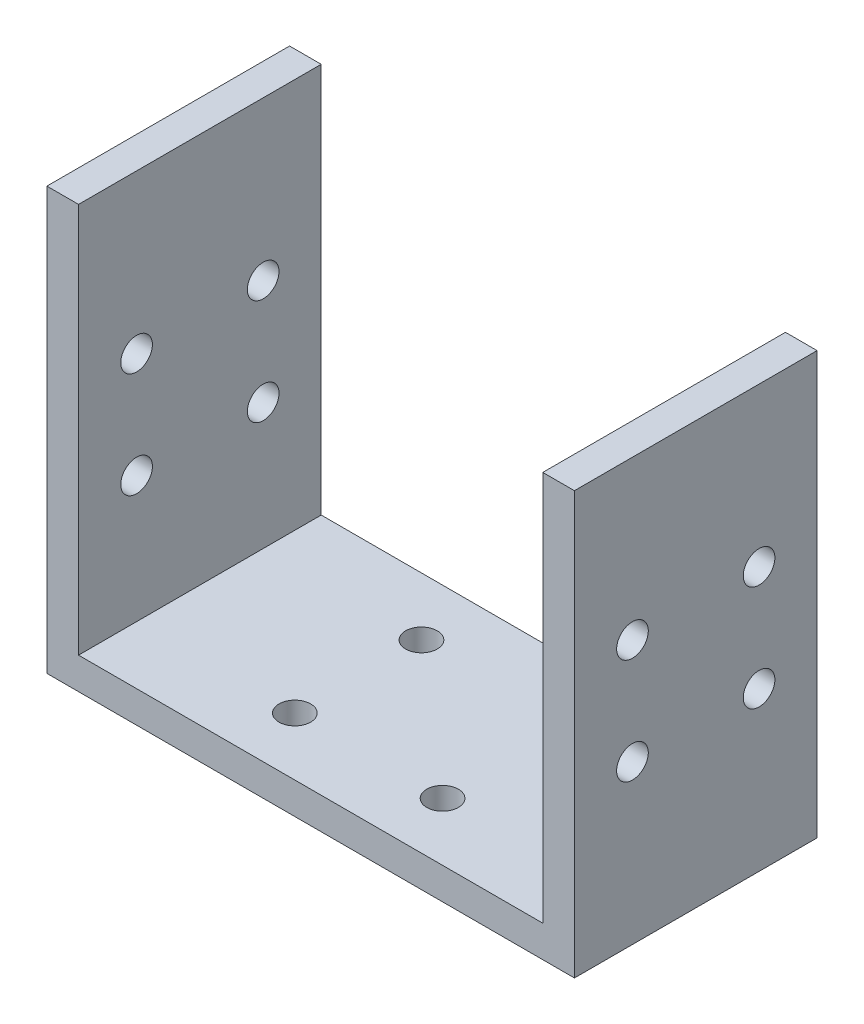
ISO-10303-21;
HEADER;
FILE_DESCRIPTION(('STEP AP214'),'2;1');
FILE_NAME('part.step','',(''),(''),'','','');
FILE_SCHEMA(('AUTOMOTIVE_DESIGN { 1 0 10303 214 1 1 1 1 }'));
ENDSEC;
DATA;
#1=APPLICATION_CONTEXT('core data for automotive mechanical design processes');
#2=APPLICATION_PROTOCOL_DEFINITION('international standard','automotive_design',2000,#1);
#3=PRODUCT_CONTEXT('',#1,'mechanical');
#4=PRODUCT('Part','Part','',(#3));
#5=PRODUCT_RELATED_PRODUCT_CATEGORY('part','',(#4));
#6=PRODUCT_DEFINITION_FORMATION('','',#4);
#7=PRODUCT_DEFINITION_CONTEXT('part definition',#1,'design');
#8=PRODUCT_DEFINITION('design','',#6,#7);
#9=PRODUCT_DEFINITION_SHAPE('','',#8);
#10=(LENGTH_UNIT() NAMED_UNIT(*) SI_UNIT(.MILLI.,.METRE.));
#11=(NAMED_UNIT(*) PLANE_ANGLE_UNIT() SI_UNIT($,.RADIAN.));
#12=(NAMED_UNIT(*) SI_UNIT($,.STERADIAN.) SOLID_ANGLE_UNIT());
#13=UNCERTAINTY_MEASURE_WITH_UNIT(LENGTH_MEASURE(1.E-05),#10,'distance_accuracy_value','');
#14=(GEOMETRIC_REPRESENTATION_CONTEXT(3) GLOBAL_UNCERTAINTY_ASSIGNED_CONTEXT((#13)) GLOBAL_UNIT_ASSIGNED_CONTEXT((#10,
#11,#12)) REPRESENTATION_CONTEXT('',''));
#15=CARTESIAN_POINT('',(0.,0.,0.));
#16=DIRECTION('',(0.,0.,1.));
#17=DIRECTION('',(1.,0.,0.));
#18=AXIS2_PLACEMENT_3D('',#15,#16,#17);
#19=CARTESIAN_POINT('',(0.,40.,0.));
#20=DIRECTION('',(0.,-1.,0.));
#21=DIRECTION('',(0.,0.,-1.));
#22=AXIS2_PLACEMENT_3D('',#19,#20,#21);
#23=PLANE('',#22);
#24=DIRECTION('',(0.,0.,-1.));
#25=VECTOR('',#24,1.);
#26=CARTESIAN_POINT('',(22.,40.,0.));
#27=LINE('',#26,#25);
#28=CARTESIAN_POINT('',(22.,40.,11.5));
#29=VERTEX_POINT('',#28);
#30=CARTESIAN_POINT('',(22.,40.,-11.5));
#31=VERTEX_POINT('',#30);
#32=EDGE_CURVE('E124',#29,#31,#27,.T.);
#33=ORIENTED_EDGE('',*,*,#32,.F.);
#34=DIRECTION('',(1.,0.,0.));
#35=VECTOR('',#34,1.);
#36=CARTESIAN_POINT('',(-25.,40.,11.5));
#37=LINE('',#36,#35);
#38=CARTESIAN_POINT('',(25.,40.,11.5));
#39=VERTEX_POINT('',#38);
#40=EDGE_CURVE('E67',#29,#39,#37,.T.);
#41=ORIENTED_EDGE('',*,*,#40,.T.);
#42=DIRECTION('',(0.,0.,-1.));
#43=VECTOR('',#42,1.);
#44=CARTESIAN_POINT('',(25.,40.,11.5));
#45=LINE('',#44,#43);
#46=CARTESIAN_POINT('',(25.,40.,-11.5));
#47=VERTEX_POINT('',#46);
#48=EDGE_CURVE('E151',#39,#47,#45,.T.);
#49=ORIENTED_EDGE('',*,*,#48,.T.);
#50=DIRECTION('',(-1.,0.,0.));
#51=VECTOR('',#50,1.);
#52=CARTESIAN_POINT('',(-25.,40.,-11.5));
#53=LINE('',#52,#51);
#54=EDGE_CURVE('E96',#47,#31,#53,.T.);
#55=ORIENTED_EDGE('',*,*,#54,.T.);
#56=EDGE_LOOP('',(#33,#41,#49,#55));
#57=FACE_BOUND('',#56,.T.);
#58=ADVANCED_FACE('F41',(#57),#23,.F.);
#59=DIRECTION('',(0.,0.,1.));
#60=VECTOR('',#59,1.);
#61=CARTESIAN_POINT('',(-22.,40.,0.));
#62=LINE('',#61,#60);
#63=CARTESIAN_POINT('',(-22.,40.,-11.5));
#64=VERTEX_POINT('',#63);
#65=CARTESIAN_POINT('',(-22.,40.,11.5));
#66=VERTEX_POINT('',#65);
#67=EDGE_CURVE('E143',#64,#66,#62,.T.);
#68=ORIENTED_EDGE('',*,*,#67,.F.);
#69=CARTESIAN_POINT('',(-25.,40.,-11.5));
#70=VERTEX_POINT('',#69);
#71=EDGE_CURVE('E153',#64,#70,#53,.T.);
#72=ORIENTED_EDGE('',*,*,#71,.T.);
#73=DIRECTION('',(0.,0.,1.));
#74=VECTOR('',#73,1.);
#75=CARTESIAN_POINT('',(-25.,40.,11.5));
#76=LINE('',#75,#74);
#77=CARTESIAN_POINT('',(-25.,40.,11.5));
#78=VERTEX_POINT('',#77);
#79=EDGE_CURVE('E155',#70,#78,#76,.T.);
#80=ORIENTED_EDGE('',*,*,#79,.T.);
#81=EDGE_CURVE('E157',#78,#66,#37,.T.);
#82=ORIENTED_EDGE('',*,*,#81,.T.);
#83=EDGE_LOOP('',(#68,#72,#80,#82));
#84=FACE_BOUND('',#83,.T.);
#85=ADVANCED_FACE('F250',(#84),#23,.F.);
#86=CARTESIAN_POINT('',(25.,40.,11.5));
#87=DIRECTION('',(-1.,0.,0.));
#88=DIRECTION('',(0.,0.,1.));
#89=AXIS2_PLACEMENT_3D('',#86,#87,#88);
#90=PLANE('',#89);
#91=CARTESIAN_POINT('',(25.,25.,6.));
#92=DIRECTION('',(-1.,0.,0.));
#93=DIRECTION('',(0.,0.,1.));
#94=AXIS2_PLACEMENT_3D('',#91,#92,#93);
#95=CIRCLE('',#94,1.5);
#96=CARTESIAN_POINT('',(25.,25.,7.5));
#97=VERTEX_POINT('',#96);
#98=EDGE_CURVE('E204',#97,#97,#95,.T.);
#99=ORIENTED_EDGE('',*,*,#98,.T.);
#100=EDGE_LOOP('',(#99));
#101=FACE_BOUND('',#100,.T.);
#102=CARTESIAN_POINT('',(25.,25.,-6.));
#103=DIRECTION('',(-1.,0.,0.));
#104=DIRECTION('',(0.,0.,1.));
#105=AXIS2_PLACEMENT_3D('',#102,#103,#104);
#106=CIRCLE('',#105,1.5);
#107=CARTESIAN_POINT('',(25.,25.,-4.5));
#108=VERTEX_POINT('',#107);
#109=EDGE_CURVE('E189',#108,#108,#106,.T.);
#110=ORIENTED_EDGE('',*,*,#109,.T.);
#111=EDGE_LOOP('',(#110));
#112=FACE_BOUND('',#111,.T.);
#113=CARTESIAN_POINT('',(25.,15.,-6.));
#114=DIRECTION('',(-1.,0.,0.));
#115=DIRECTION('',(0.,0.,1.));
#116=AXIS2_PLACEMENT_3D('',#113,#114,#115);
#117=CIRCLE('',#116,1.5);
#118=CARTESIAN_POINT('',(25.,15.,-4.5));
#119=VERTEX_POINT('',#118);
#120=EDGE_CURVE('E185',#119,#119,#117,.T.);
#121=ORIENTED_EDGE('',*,*,#120,.T.);
#122=EDGE_LOOP('',(#121));
#123=FACE_BOUND('',#122,.T.);
#124=CARTESIAN_POINT('',(25.,15.,6.));
#125=DIRECTION('',(-1.,0.,0.));
#126=DIRECTION('',(0.,0.,1.));
#127=AXIS2_PLACEMENT_3D('',#124,#125,#126);
#128=CIRCLE('',#127,1.5);
#129=CARTESIAN_POINT('',(25.,15.,7.5));
#130=VERTEX_POINT('',#129);
#131=EDGE_CURVE('E181',#130,#130,#128,.T.);
#132=ORIENTED_EDGE('',*,*,#131,.T.);
#133=EDGE_LOOP('',(#132));
#134=FACE_BOUND('',#133,.T.);
#135=DIRECTION('',(0.,0.,-1.));
#136=VECTOR('',#135,1.);
#137=CARTESIAN_POINT('',(25.,0.,11.5));
#138=LINE('',#137,#136);
#139=CARTESIAN_POINT('',(25.,0.,11.5));
#140=VERTEX_POINT('',#139);
#141=CARTESIAN_POINT('',(25.,0.,-11.5));
#142=VERTEX_POINT('',#141);
#143=EDGE_CURVE('E126',#140,#142,#138,.T.);
#144=ORIENTED_EDGE('',*,*,#143,.T.);
#145=DIRECTION('',(0.,-1.,0.));
#146=VECTOR('',#145,1.);
#147=CARTESIAN_POINT('',(25.,40.,-11.5));
#148=LINE('',#147,#146);
#149=EDGE_CURVE('E11',#47,#142,#148,.T.);
#150=ORIENTED_EDGE('',*,*,#149,.F.);
#151=ORIENTED_EDGE('',*,*,#48,.F.);
#152=DIRECTION('',(0.,-1.,0.));
#153=VECTOR('',#152,1.);
#154=CARTESIAN_POINT('',(25.,40.,11.5));
#155=LINE('',#154,#153);
#156=EDGE_CURVE('E160',#39,#140,#155,.T.);
#157=ORIENTED_EDGE('',*,*,#156,.T.);
#158=EDGE_LOOP('',(#144,#150,#151,#157));
#159=FACE_BOUND('',#158,.T.);
#160=ADVANCED_FACE('F43',(#101,#112,#123,#134,#159),#90,.F.);
#161=CARTESIAN_POINT('',(-25.,40.,-11.5));
#162=DIRECTION('',(0.,0.,1.));
#163=DIRECTION('',(1.,0.,0.));
#164=AXIS2_PLACEMENT_3D('',#161,#162,#163);
#165=PLANE('',#164);
#166=ORIENTED_EDGE('',*,*,#71,.F.);
#167=DIRECTION('',(0.,-1.,0.));
#168=VECTOR('',#167,1.);
#169=CARTESIAN_POINT('',(-22.,40.,-11.5));
#170=LINE('',#169,#168);
#171=CARTESIAN_POINT('',(-22.,3.,-11.5));
#172=VERTEX_POINT('',#171);
#173=EDGE_CURVE('E58',#64,#172,#170,.T.);
#174=ORIENTED_EDGE('',*,*,#173,.T.);
#175=DIRECTION('',(-1.,0.,0.));
#176=VECTOR('',#175,1.);
#177=CARTESIAN_POINT('',(0.,3.,-11.5));
#178=LINE('',#177,#176);
#179=CARTESIAN_POINT('',(22.,3.,-11.5));
#180=VERTEX_POINT('',#179);
#181=EDGE_CURVE('E130',#180,#172,#178,.T.);
#182=ORIENTED_EDGE('',*,*,#181,.F.);
#183=DIRECTION('',(0.,-1.,0.));
#184=VECTOR('',#183,1.);
#185=CARTESIAN_POINT('',(22.,40.,-11.5));
#186=LINE('',#185,#184);
#187=EDGE_CURVE('E119',#31,#180,#186,.T.);
#188=ORIENTED_EDGE('',*,*,#187,.F.);
#189=ORIENTED_EDGE('',*,*,#54,.F.);
#190=ORIENTED_EDGE('',*,*,#149,.T.);
#191=DIRECTION('',(-1.,0.,0.));
#192=VECTOR('',#191,1.);
#193=CARTESIAN_POINT('',(-25.,0.,-11.5));
#194=LINE('',#193,#192);
#195=CARTESIAN_POINT('',(-25.,0.,-11.5));
#196=VERTEX_POINT('',#195);
#197=EDGE_CURVE('E163',#142,#196,#194,.T.);
#198=ORIENTED_EDGE('',*,*,#197,.T.);
#199=DIRECTION('',(0.,-1.,0.));
#200=VECTOR('',#199,1.);
#201=CARTESIAN_POINT('',(-25.,40.,-11.5));
#202=LINE('',#201,#200);
#203=EDGE_CURVE('E50',#70,#196,#202,.T.);
#204=ORIENTED_EDGE('',*,*,#203,.F.);
#205=EDGE_LOOP('',(#166,#174,#182,#188,#189,#190,#198,#204));
#206=FACE_BOUND('',#205,.T.);
#207=ADVANCED_FACE('F136',(#206),#165,.F.);
#208=CARTESIAN_POINT('',(-25.,40.,11.5));
#209=DIRECTION('',(1.,0.,0.));
#210=DIRECTION('',(0.,0.,-1.));
#211=AXIS2_PLACEMENT_3D('',#208,#209,#210);
#212=PLANE('',#211);
#213=CARTESIAN_POINT('',(-25.,25.,6.));
#214=DIRECTION('',(1.,0.,0.));
#215=DIRECTION('',(0.,0.,-1.));
#216=AXIS2_PLACEMENT_3D('',#213,#214,#215);
#217=CIRCLE('',#216,1.5);
#218=CARTESIAN_POINT('',(-25.,25.,4.5));
#219=VERTEX_POINT('',#218);
#220=EDGE_CURVE('E298',#219,#219,#217,.T.);
#221=ORIENTED_EDGE('',*,*,#220,.T.);
#222=EDGE_LOOP('',(#221));
#223=FACE_BOUND('',#222,.T.);
#224=CARTESIAN_POINT('',(-25.,25.,-6.));
#225=DIRECTION('',(1.,0.,0.));
#226=DIRECTION('',(0.,0.,-1.));
#227=AXIS2_PLACEMENT_3D('',#224,#225,#226);
#228=CIRCLE('',#227,1.5);
#229=CARTESIAN_POINT('',(-25.,25.,-7.5));
#230=VERTEX_POINT('',#229);
#231=EDGE_CURVE('E301',#230,#230,#228,.T.);
#232=ORIENTED_EDGE('',*,*,#231,.T.);
#233=EDGE_LOOP('',(#232));
#234=FACE_BOUND('',#233,.T.);
#235=CARTESIAN_POINT('',(-25.,15.,-6.));
#236=DIRECTION('',(1.,0.,0.));
#237=DIRECTION('',(0.,0.,-1.));
#238=AXIS2_PLACEMENT_3D('',#235,#236,#237);
#239=CIRCLE('',#238,1.5);
#240=CARTESIAN_POINT('',(-25.,15.,-7.5));
#241=VERTEX_POINT('',#240);
#242=EDGE_CURVE('E297',#241,#241,#239,.T.);
#243=ORIENTED_EDGE('',*,*,#242,.T.);
#244=EDGE_LOOP('',(#243));
#245=FACE_BOUND('',#244,.T.);
#246=CARTESIAN_POINT('',(-25.,15.,6.));
#247=DIRECTION('',(1.,0.,0.));
#248=DIRECTION('',(0.,0.,-1.));
#249=AXIS2_PLACEMENT_3D('',#246,#247,#248);
#250=CIRCLE('',#249,1.5);
#251=CARTESIAN_POINT('',(-25.,15.,4.5));
#252=VERTEX_POINT('',#251);
#253=EDGE_CURVE('E177',#252,#252,#250,.T.);
#254=ORIENTED_EDGE('',*,*,#253,.T.);
#255=EDGE_LOOP('',(#254));
#256=FACE_BOUND('',#255,.T.);
#257=DIRECTION('',(0.,0.,1.));
#258=VECTOR('',#257,1.);
#259=CARTESIAN_POINT('',(-25.,0.,11.5));
#260=LINE('',#259,#258);
#261=CARTESIAN_POINT('',(-25.,0.,11.5));
#262=VERTEX_POINT('',#261);
#263=EDGE_CURVE('E165',#196,#262,#260,.T.);
#264=ORIENTED_EDGE('',*,*,#263,.T.);
#265=DIRECTION('',(0.,-1.,0.));
#266=VECTOR('',#265,1.);
#267=CARTESIAN_POINT('',(-25.,40.,11.5));
#268=LINE('',#267,#266);
#269=EDGE_CURVE('E169',#78,#262,#268,.T.);
#270=ORIENTED_EDGE('',*,*,#269,.F.);
#271=ORIENTED_EDGE('',*,*,#79,.F.);
#272=ORIENTED_EDGE('',*,*,#203,.T.);
#273=EDGE_LOOP('',(#264,#270,#271,#272));
#274=FACE_BOUND('',#273,.T.);
#275=ADVANCED_FACE('F263',(#223,#234,#245,#256,#274),#212,.F.);
#276=CARTESIAN_POINT('',(-25.,40.,11.5));
#277=DIRECTION('',(0.,0.,-1.));
#278=DIRECTION('',(-1.,0.,0.));
#279=AXIS2_PLACEMENT_3D('',#276,#277,#278);
#280=PLANE('',#279);
#281=ORIENTED_EDGE('',*,*,#40,.F.);
#282=DIRECTION('',(0.,-1.,0.));
#283=VECTOR('',#282,1.);
#284=CARTESIAN_POINT('',(22.,40.,11.5));
#285=LINE('',#284,#283);
#286=CARTESIAN_POINT('',(22.,3.,11.5));
#287=VERTEX_POINT('',#286);
#288=EDGE_CURVE('E145',#29,#287,#285,.T.);
#289=ORIENTED_EDGE('',*,*,#288,.T.);
#290=DIRECTION('',(1.,0.,0.));
#291=VECTOR('',#290,1.);
#292=CARTESIAN_POINT('',(0.,3.,11.5));
#293=LINE('',#292,#291);
#294=CARTESIAN_POINT('',(-22.,3.,11.5));
#295=VERTEX_POINT('',#294);
#296=EDGE_CURVE('E132',#295,#287,#293,.T.);
#297=ORIENTED_EDGE('',*,*,#296,.F.);
#298=DIRECTION('',(0.,-1.,0.));
#299=VECTOR('',#298,1.);
#300=CARTESIAN_POINT('',(-22.,40.,11.5));
#301=LINE('',#300,#299);
#302=EDGE_CURVE('E142',#66,#295,#301,.T.);
#303=ORIENTED_EDGE('',*,*,#302,.F.);
#304=ORIENTED_EDGE('',*,*,#81,.F.);
#305=ORIENTED_EDGE('',*,*,#269,.T.);
#306=DIRECTION('',(1.,0.,0.));
#307=VECTOR('',#306,1.);
#308=CARTESIAN_POINT('',(-25.,0.,11.5));
#309=LINE('',#308,#307);
#310=EDGE_CURVE('E89',#262,#140,#309,.T.);
#311=ORIENTED_EDGE('',*,*,#310,.T.);
#312=ORIENTED_EDGE('',*,*,#156,.F.);
#313=EDGE_LOOP('',(#281,#289,#297,#303,#304,#305,#311,#312));
#314=FACE_BOUND('',#313,.T.);
#315=ADVANCED_FACE('F259',(#314),#280,.F.);
#316=CARTESIAN_POINT('',(0.,0.,0.));
#317=DIRECTION('',(0.,-1.,0.));
#318=DIRECTION('',(0.,0.,-1.));
#319=AXIS2_PLACEMENT_3D('',#316,#317,#318);
#320=PLANE('',#319);
#321=CARTESIAN_POINT('',(-7.,0.,6.));
#322=DIRECTION('',(0.,-1.,0.));
#323=DIRECTION('',(0.,0.,-1.));
#324=AXIS2_PLACEMENT_3D('',#321,#322,#323);
#325=CIRCLE('',#324,1.5);
#326=CARTESIAN_POINT('',(-7.,0.,4.5));
#327=VERTEX_POINT('',#326);
#328=EDGE_CURVE('E219',#327,#327,#325,.T.);
#329=ORIENTED_EDGE('',*,*,#328,.F.);
#330=EDGE_LOOP('',(#329));
#331=FACE_BOUND('',#330,.T.);
#332=CARTESIAN_POINT('',(-7.,0.,-6.));
#333=DIRECTION('',(0.,-1.,0.));
#334=DIRECTION('',(0.,0.,-1.));
#335=AXIS2_PLACEMENT_3D('',#332,#333,#334);
#336=CIRCLE('',#335,1.5);
#337=CARTESIAN_POINT('',(-7.,0.,-7.5));
#338=VERTEX_POINT('',#337);
#339=EDGE_CURVE('E212',#338,#338,#336,.T.);
#340=ORIENTED_EDGE('',*,*,#339,.F.);
#341=EDGE_LOOP('',(#340));
#342=FACE_BOUND('',#341,.T.);
#343=CARTESIAN_POINT('',(7.,0.,-6.));
#344=DIRECTION('',(0.,-1.,0.));
#345=DIRECTION('',(0.,0.,-1.));
#346=AXIS2_PLACEMENT_3D('',#343,#344,#345);
#347=CIRCLE('',#346,1.5);
#348=CARTESIAN_POINT('',(7.,0.,-7.5));
#349=VERTEX_POINT('',#348);
#350=EDGE_CURVE('E211',#349,#349,#347,.T.);
#351=ORIENTED_EDGE('',*,*,#350,.F.);
#352=EDGE_LOOP('',(#351));
#353=FACE_BOUND('',#352,.T.);
#354=CARTESIAN_POINT('',(7.,0.,6.));
#355=DIRECTION('',(0.,-1.,0.));
#356=DIRECTION('',(0.,0.,-1.));
#357=AXIS2_PLACEMENT_3D('',#354,#355,#356);
#358=CIRCLE('',#357,1.5);
#359=CARTESIAN_POINT('',(7.,0.,4.5));
#360=VERTEX_POINT('',#359);
#361=EDGE_CURVE('E215',#360,#360,#358,.T.);
#362=ORIENTED_EDGE('',*,*,#361,.F.);
#363=EDGE_LOOP('',(#362));
#364=FACE_BOUND('',#363,.T.);
#365=ORIENTED_EDGE('',*,*,#143,.F.);
#366=ORIENTED_EDGE('',*,*,#310,.F.);
#367=ORIENTED_EDGE('',*,*,#263,.F.);
#368=ORIENTED_EDGE('',*,*,#197,.F.);
#369=EDGE_LOOP('',(#365,#366,#367,#368));
#370=FACE_BOUND('',#369,.T.);
#371=ADVANCED_FACE('F256',(#331,#342,#353,#364,#370),#320,.T.);
#372=CARTESIAN_POINT('',(22.,40.,11.5));
#373=DIRECTION('',(-1.,0.,0.));
#374=DIRECTION('',(0.,0.,1.));
#375=AXIS2_PLACEMENT_3D('',#372,#373,#374);
#376=PLANE('',#375);
#377=CARTESIAN_POINT('',(22.,25.,6.));
#378=DIRECTION('',(-1.,0.,0.));
#379=DIRECTION('',(0.,0.,1.));
#380=AXIS2_PLACEMENT_3D('',#377,#378,#379);
#381=CIRCLE('',#380,1.5);
#382=CARTESIAN_POINT('',(22.,25.,7.5));
#383=VERTEX_POINT('',#382);
#384=EDGE_CURVE('E201',#383,#383,#381,.T.);
#385=ORIENTED_EDGE('',*,*,#384,.F.);
#386=EDGE_LOOP('',(#385));
#387=FACE_BOUND('',#386,.T.);
#388=CARTESIAN_POINT('',(22.,25.,-6.));
#389=DIRECTION('',(-1.,0.,0.));
#390=DIRECTION('',(0.,0.,1.));
#391=AXIS2_PLACEMENT_3D('',#388,#389,#390);
#392=CIRCLE('',#391,1.5);
#393=CARTESIAN_POINT('',(22.,25.,-4.5));
#394=VERTEX_POINT('',#393);
#395=EDGE_CURVE('E184',#394,#394,#392,.T.);
#396=ORIENTED_EDGE('',*,*,#395,.F.);
#397=EDGE_LOOP('',(#396));
#398=FACE_BOUND('',#397,.T.);
#399=CARTESIAN_POINT('',(22.,15.,-6.));
#400=DIRECTION('',(-1.,0.,0.));
#401=DIRECTION('',(0.,0.,1.));
#402=AXIS2_PLACEMENT_3D('',#399,#400,#401);
#403=CIRCLE('',#402,1.5);
#404=CARTESIAN_POINT('',(22.,15.,-4.5));
#405=VERTEX_POINT('',#404);
#406=EDGE_CURVE('E180',#405,#405,#403,.T.);
#407=ORIENTED_EDGE('',*,*,#406,.F.);
#408=EDGE_LOOP('',(#407));
#409=FACE_BOUND('',#408,.T.);
#410=CARTESIAN_POINT('',(22.,15.,6.));
#411=DIRECTION('',(-1.,0.,0.));
#412=DIRECTION('',(0.,0.,1.));
#413=AXIS2_PLACEMENT_3D('',#410,#411,#412);
#414=CIRCLE('',#413,1.5);
#415=CARTESIAN_POINT('',(22.,15.,7.5));
#416=VERTEX_POINT('',#415);
#417=EDGE_CURVE('E176',#416,#416,#414,.T.);
#418=ORIENTED_EDGE('',*,*,#417,.F.);
#419=EDGE_LOOP('',(#418));
#420=FACE_BOUND('',#419,.T.);
#421=DIRECTION('',(0.,0.,-1.));
#422=VECTOR('',#421,1.);
#423=CARTESIAN_POINT('',(22.,3.,0.));
#424=LINE('',#423,#422);
#425=EDGE_CURVE('E122',#287,#180,#424,.T.);
#426=ORIENTED_EDGE('',*,*,#425,.F.);
#427=ORIENTED_EDGE('',*,*,#288,.F.);
#428=ORIENTED_EDGE('',*,*,#32,.T.);
#429=ORIENTED_EDGE('',*,*,#187,.T.);
#430=EDGE_LOOP('',(#426,#427,#428,#429));
#431=FACE_BOUND('',#430,.T.);
#432=ADVANCED_FACE('F121',(#387,#398,#409,#420,#431),#376,.T.);
#433=CARTESIAN_POINT('',(-22.,40.,11.5));
#434=DIRECTION('',(1.,0.,0.));
#435=DIRECTION('',(0.,0.,-1.));
#436=AXIS2_PLACEMENT_3D('',#433,#434,#435);
#437=PLANE('',#436);
#438=CARTESIAN_POINT('',(-22.,25.,6.));
#439=DIRECTION('',(1.,0.,0.));
#440=DIRECTION('',(0.,0.,-1.));
#441=AXIS2_PLACEMENT_3D('',#438,#439,#440);
#442=CIRCLE('',#441,1.5);
#443=CARTESIAN_POINT('',(-22.,25.,4.5));
#444=VERTEX_POINT('',#443);
#445=EDGE_CURVE('E45',#444,#444,#442,.T.);
#446=ORIENTED_EDGE('',*,*,#445,.F.);
#447=EDGE_LOOP('',(#446));
#448=FACE_BOUND('',#447,.T.);
#449=CARTESIAN_POINT('',(-22.,25.,-6.));
#450=DIRECTION('',(1.,0.,0.));
#451=DIRECTION('',(0.,0.,-1.));
#452=AXIS2_PLACEMENT_3D('',#449,#450,#451);
#453=CIRCLE('',#452,1.5);
#454=CARTESIAN_POINT('',(-22.,25.,-7.5));
#455=VERTEX_POINT('',#454);
#456=EDGE_CURVE('E182',#455,#455,#453,.T.);
#457=ORIENTED_EDGE('',*,*,#456,.F.);
#458=EDGE_LOOP('',(#457));
#459=FACE_BOUND('',#458,.T.);
#460=CARTESIAN_POINT('',(-22.,15.,-6.));
#461=DIRECTION('',(1.,0.,0.));
#462=DIRECTION('',(0.,0.,-1.));
#463=AXIS2_PLACEMENT_3D('',#460,#461,#462);
#464=CIRCLE('',#463,1.5);
#465=CARTESIAN_POINT('',(-22.,15.,-7.5));
#466=VERTEX_POINT('',#465);
#467=EDGE_CURVE('E178',#466,#466,#464,.T.);
#468=ORIENTED_EDGE('',*,*,#467,.F.);
#469=EDGE_LOOP('',(#468));
#470=FACE_BOUND('',#469,.T.);
#471=CARTESIAN_POINT('',(-22.,15.,6.));
#472=DIRECTION('',(1.,0.,0.));
#473=DIRECTION('',(0.,0.,-1.));
#474=AXIS2_PLACEMENT_3D('',#471,#472,#473);
#475=CIRCLE('',#474,1.5);
#476=CARTESIAN_POINT('',(-22.,15.,4.5));
#477=VERTEX_POINT('',#476);
#478=EDGE_CURVE('E173',#477,#477,#475,.T.);
#479=ORIENTED_EDGE('',*,*,#478,.F.);
#480=EDGE_LOOP('',(#479));
#481=FACE_BOUND('',#480,.T.);
#482=DIRECTION('',(0.,0.,1.));
#483=VECTOR('',#482,1.);
#484=CARTESIAN_POINT('',(-22.,3.,0.));
#485=LINE('',#484,#483);
#486=EDGE_CURVE('E137',#172,#295,#485,.T.);
#487=ORIENTED_EDGE('',*,*,#486,.F.);
#488=ORIENTED_EDGE('',*,*,#173,.F.);
#489=ORIENTED_EDGE('',*,*,#67,.T.);
#490=ORIENTED_EDGE('',*,*,#302,.T.);
#491=EDGE_LOOP('',(#487,#488,#489,#490));
#492=FACE_BOUND('',#491,.T.);
#493=ADVANCED_FACE('F234',(#448,#459,#470,#481,#492),#437,.T.);
#494=CARTESIAN_POINT('',(0.,3.,0.));
#495=DIRECTION('',(0.,-1.,0.));
#496=DIRECTION('',(0.,0.,-1.));
#497=AXIS2_PLACEMENT_3D('',#494,#495,#496);
#498=PLANE('',#497);
#499=CARTESIAN_POINT('',(-7.,3.,6.));
#500=DIRECTION('',(0.,-1.,0.));
#501=DIRECTION('',(0.,0.,-1.));
#502=AXIS2_PLACEMENT_3D('',#499,#500,#501);
#503=CIRCLE('',#502,1.5);
#504=CARTESIAN_POINT('',(-7.,3.,4.5));
#505=VERTEX_POINT('',#504);
#506=EDGE_CURVE('E207',#505,#505,#503,.F.);
#507=ORIENTED_EDGE('',*,*,#506,.F.);
#508=EDGE_LOOP('',(#507));
#509=FACE_BOUND('',#508,.T.);
#510=CARTESIAN_POINT('',(-7.,3.,-6.));
#511=DIRECTION('',(0.,-1.,0.));
#512=DIRECTION('',(0.,0.,-1.));
#513=AXIS2_PLACEMENT_3D('',#510,#511,#512);
#514=CIRCLE('',#513,1.5);
#515=CARTESIAN_POINT('',(-7.,3.,-7.5));
#516=VERTEX_POINT('',#515);
#517=EDGE_CURVE('E216',#516,#516,#514,.F.);
#518=ORIENTED_EDGE('',*,*,#517,.F.);
#519=EDGE_LOOP('',(#518));
#520=FACE_BOUND('',#519,.T.);
#521=CARTESIAN_POINT('',(7.,3.,-6.));
#522=DIRECTION('',(0.,-1.,0.));
#523=DIRECTION('',(0.,0.,-1.));
#524=AXIS2_PLACEMENT_3D('',#521,#522,#523);
#525=CIRCLE('',#524,1.5);
#526=CARTESIAN_POINT('',(7.,3.,-7.5));
#527=VERTEX_POINT('',#526);
#528=EDGE_CURVE('E208',#527,#527,#525,.F.);
#529=ORIENTED_EDGE('',*,*,#528,.F.);
#530=EDGE_LOOP('',(#529));
#531=FACE_BOUND('',#530,.T.);
#532=CARTESIAN_POINT('',(7.,3.,6.));
#533=DIRECTION('',(0.,-1.,0.));
#534=DIRECTION('',(0.,0.,-1.));
#535=AXIS2_PLACEMENT_3D('',#532,#533,#534);
#536=CIRCLE('',#535,1.5);
#537=CARTESIAN_POINT('',(7.,3.,4.5));
#538=VERTEX_POINT('',#537);
#539=EDGE_CURVE('E133',#538,#538,#536,.F.);
#540=ORIENTED_EDGE('',*,*,#539,.F.);
#541=EDGE_LOOP('',(#540));
#542=FACE_BOUND('',#541,.T.);
#543=ORIENTED_EDGE('',*,*,#425,.T.);
#544=ORIENTED_EDGE('',*,*,#181,.T.);
#545=ORIENTED_EDGE('',*,*,#486,.T.);
#546=ORIENTED_EDGE('',*,*,#296,.T.);
#547=EDGE_LOOP('',(#543,#544,#545,#546));
#548=FACE_BOUND('',#547,.T.);
#549=ADVANCED_FACE('F129',(#509,#520,#531,#542,#548),#498,.F.);
#550=CARTESIAN_POINT('',(7.,40.001,6.));
#551=DIRECTION('',(0.,-1.,0.));
#552=DIRECTION('',(0.,0.,-1.));
#553=AXIS2_PLACEMENT_3D('',#550,#551,#552);
#554=CYLINDRICAL_SURFACE('',#553,1.5);
#555=ORIENTED_EDGE('',*,*,#361,.T.);
#556=EDGE_LOOP('',(#555));
#557=FACE_BOUND('',#556,.T.);
#558=ORIENTED_EDGE('',*,*,#539,.T.);
#559=EDGE_LOOP('',(#558));
#560=FACE_BOUND('',#559,.T.);
#561=ADVANCED_FACE('F231',(#557,#560),#554,.F.);
#562=CARTESIAN_POINT('',(7.,40.001,-6.));
#563=DIRECTION('',(0.,-1.,0.));
#564=DIRECTION('',(0.,0.,-1.));
#565=AXIS2_PLACEMENT_3D('',#562,#563,#564);
#566=CYLINDRICAL_SURFACE('',#565,1.5);
#567=ORIENTED_EDGE('',*,*,#350,.T.);
#568=EDGE_LOOP('',(#567));
#569=FACE_BOUND('',#568,.T.);
#570=ORIENTED_EDGE('',*,*,#528,.T.);
#571=EDGE_LOOP('',(#570));
#572=FACE_BOUND('',#571,.T.);
#573=ADVANCED_FACE('F241',(#569,#572),#566,.F.);
#574=CARTESIAN_POINT('',(-7.,40.001,-6.));
#575=DIRECTION('',(0.,-1.,0.));
#576=DIRECTION('',(0.,0.,-1.));
#577=AXIS2_PLACEMENT_3D('',#574,#575,#576);
#578=CYLINDRICAL_SURFACE('',#577,1.5);
#579=ORIENTED_EDGE('',*,*,#339,.T.);
#580=EDGE_LOOP('',(#579));
#581=FACE_BOUND('',#580,.T.);
#582=ORIENTED_EDGE('',*,*,#517,.T.);
#583=EDGE_LOOP('',(#582));
#584=FACE_BOUND('',#583,.T.);
#585=ADVANCED_FACE('F351',(#581,#584),#578,.F.);
#586=CARTESIAN_POINT('',(-7.,40.001,6.));
#587=DIRECTION('',(0.,-1.,0.));
#588=DIRECTION('',(0.,0.,-1.));
#589=AXIS2_PLACEMENT_3D('',#586,#587,#588);
#590=CYLINDRICAL_SURFACE('',#589,1.5);
#591=ORIENTED_EDGE('',*,*,#328,.T.);
#592=EDGE_LOOP('',(#591));
#593=FACE_BOUND('',#592,.T.);
#594=ORIENTED_EDGE('',*,*,#506,.T.);
#595=EDGE_LOOP('',(#594));
#596=FACE_BOUND('',#595,.T.);
#597=ADVANCED_FACE('F323',(#593,#596),#590,.F.);
#598=CARTESIAN_POINT('',(-25.,15.,6.));
#599=DIRECTION('',(1.,0.,0.));
#600=DIRECTION('',(0.,0.,-1.));
#601=AXIS2_PLACEMENT_3D('',#598,#599,#600);
#602=CYLINDRICAL_SURFACE('',#601,1.5);
#603=ORIENTED_EDGE('',*,*,#478,.T.);
#604=EDGE_LOOP('',(#603));
#605=FACE_BOUND('',#604,.T.);
#606=ORIENTED_EDGE('',*,*,#253,.F.);
#607=EDGE_LOOP('',(#606));
#608=FACE_BOUND('',#607,.T.);
#609=ADVANCED_FACE('F312',(#605,#608),#602,.F.);
#610=CARTESIAN_POINT('',(-25.,15.,-6.));
#611=DIRECTION('',(1.,0.,0.));
#612=DIRECTION('',(0.,0.,-1.));
#613=AXIS2_PLACEMENT_3D('',#610,#611,#612);
#614=CYLINDRICAL_SURFACE('',#613,1.5);
#615=ORIENTED_EDGE('',*,*,#467,.T.);
#616=EDGE_LOOP('',(#615));
#617=FACE_BOUND('',#616,.T.);
#618=ORIENTED_EDGE('',*,*,#242,.F.);
#619=EDGE_LOOP('',(#618));
#620=FACE_BOUND('',#619,.T.);
#621=ADVANCED_FACE('F309',(#617,#620),#614,.F.);
#622=CARTESIAN_POINT('',(-25.,25.,-6.));
#623=DIRECTION('',(1.,0.,0.));
#624=DIRECTION('',(0.,0.,-1.));
#625=AXIS2_PLACEMENT_3D('',#622,#623,#624);
#626=CYLINDRICAL_SURFACE('',#625,1.5);
#627=ORIENTED_EDGE('',*,*,#456,.T.);
#628=EDGE_LOOP('',(#627));
#629=FACE_BOUND('',#628,.T.);
#630=ORIENTED_EDGE('',*,*,#231,.F.);
#631=EDGE_LOOP('',(#630));
#632=FACE_BOUND('',#631,.T.);
#633=ADVANCED_FACE('F311',(#629,#632),#626,.F.);
#634=CARTESIAN_POINT('',(-25.,25.,6.));
#635=DIRECTION('',(1.,0.,0.));
#636=DIRECTION('',(0.,0.,-1.));
#637=AXIS2_PLACEMENT_3D('',#634,#635,#636);
#638=CYLINDRICAL_SURFACE('',#637,1.5);
#639=ORIENTED_EDGE('',*,*,#445,.T.);
#640=EDGE_LOOP('',(#639));
#641=FACE_BOUND('',#640,.T.);
#642=ORIENTED_EDGE('',*,*,#220,.F.);
#643=EDGE_LOOP('',(#642));
#644=FACE_BOUND('',#643,.T.);
#645=ADVANCED_FACE('F320',(#641,#644),#638,.F.);
#646=ORIENTED_EDGE('',*,*,#417,.T.);
#647=EDGE_LOOP('',(#646));
#648=FACE_BOUND('',#647,.T.);
#649=ORIENTED_EDGE('',*,*,#131,.F.);
#650=EDGE_LOOP('',(#649));
#651=FACE_BOUND('',#650,.T.);
#652=ADVANCED_FACE('F326',(#648,#651),#602,.F.);
#653=ORIENTED_EDGE('',*,*,#406,.T.);
#654=EDGE_LOOP('',(#653));
#655=FACE_BOUND('',#654,.T.);
#656=ORIENTED_EDGE('',*,*,#120,.F.);
#657=EDGE_LOOP('',(#656));
#658=FACE_BOUND('',#657,.T.);
#659=ADVANCED_FACE('F315',(#655,#658),#614,.F.);
#660=ORIENTED_EDGE('',*,*,#395,.T.);
#661=EDGE_LOOP('',(#660));
#662=FACE_BOUND('',#661,.T.);
#663=ORIENTED_EDGE('',*,*,#109,.F.);
#664=EDGE_LOOP('',(#663));
#665=FACE_BOUND('',#664,.T.);
#666=ADVANCED_FACE('F322',(#662,#665),#626,.F.);
#667=ORIENTED_EDGE('',*,*,#384,.T.);
#668=EDGE_LOOP('',(#667));
#669=FACE_BOUND('',#668,.T.);
#670=ORIENTED_EDGE('',*,*,#98,.F.);
#671=EDGE_LOOP('',(#670));
#672=FACE_BOUND('',#671,.T.);
#673=ADVANCED_FACE('F333',(#669,#672),#638,.F.);
#674=CLOSED_SHELL('',(#58,#85,#160,#207,#275,#315,#371,#432,#493,#549,#561,#573,#585,#597,#609,
#621,#633,#645,#652,#659,#666,#673));
#675=MANIFOLD_SOLID_BREP('B2',#674);
#676=ADVANCED_BREP_SHAPE_REPRESENTATION('',(#18,#675),#14);
#677=SHAPE_DEFINITION_REPRESENTATION(#9,#676);
ENDSEC;
END-ISO-10303-21;
